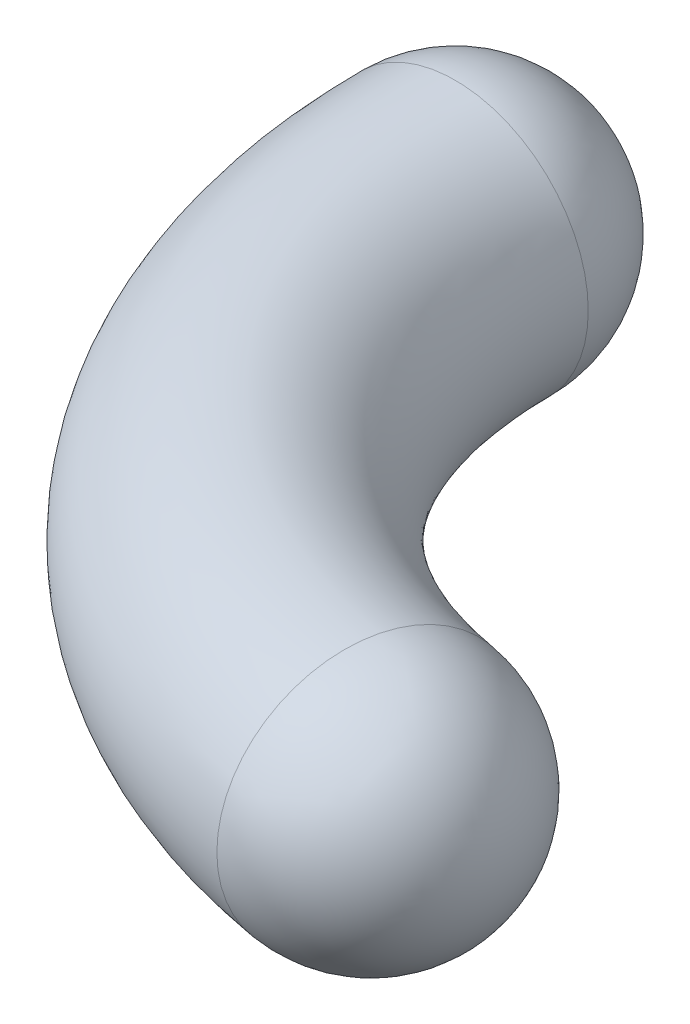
from build123d import *

# Parameters (mm, degrees)
SKETCH2_R         = 10
REVOLVE1_ANGLE    = 80
DOME1_FACE_RADIUS = 10
DOME1_HEIGHT      = 10
DOME2_FACE_RADIUS = 10
DOME2_HEIGHT      = 10


with BuildPart() as part:
    # Sketch2 → Revolve1 (revolve)
    with BuildSketch(Plane.XY):
        with Locations((-40, 0)):
            Circle(SKETCH2_R)
    revolve(axis=Axis((0, 0, 0), (0, 1, 0)), revolution_arc=REVOLVE1_ANGLE)

    # Dome1: a dome of height H over a round flat face of radius A is a cap of a sphere of radius (A * A + H * H) / (2 * H)
    dome1_r = (DOME1_FACE_RADIUS * DOME1_FACE_RADIUS + DOME1_HEIGHT * DOME1_HEIGHT) / (2 * DOME1_HEIGHT)
    dome1_base = Plane((-40, 0, 0), z_dir=(0, 0, -1))
    with Locations(dome1_base.offset(DOME1_HEIGHT - dome1_r)):
        dome1_ball = Sphere(dome1_r, mode=Mode.PRIVATE)
    add(split(dome1_ball, bisect_by=dome1_base, keep=Keep.TOP, mode=Mode.PRIVATE))

    # Dome2: a dome of height H over a round flat face of radius A is a cap of a sphere of radius (A * A + H * H) / (2 * H)
    dome2_r = (DOME2_FACE_RADIUS * DOME2_FACE_RADIUS + DOME2_HEIGHT * DOME2_HEIGHT) / (2 * DOME2_HEIGHT)
    dome2_base = Plane((-6.945927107, 0, 39.39231012), z_dir=(0.984807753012, 0, 0.173648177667))
    with Locations(dome2_base.offset(DOME2_HEIGHT - dome2_r)):
        dome2_ball = Sphere(dome2_r, mode=Mode.PRIVATE)
    add(split(dome2_ball, bisect_by=dome2_base, keep=Keep.TOP, mode=Mode.PRIVATE))


solid = part.part
